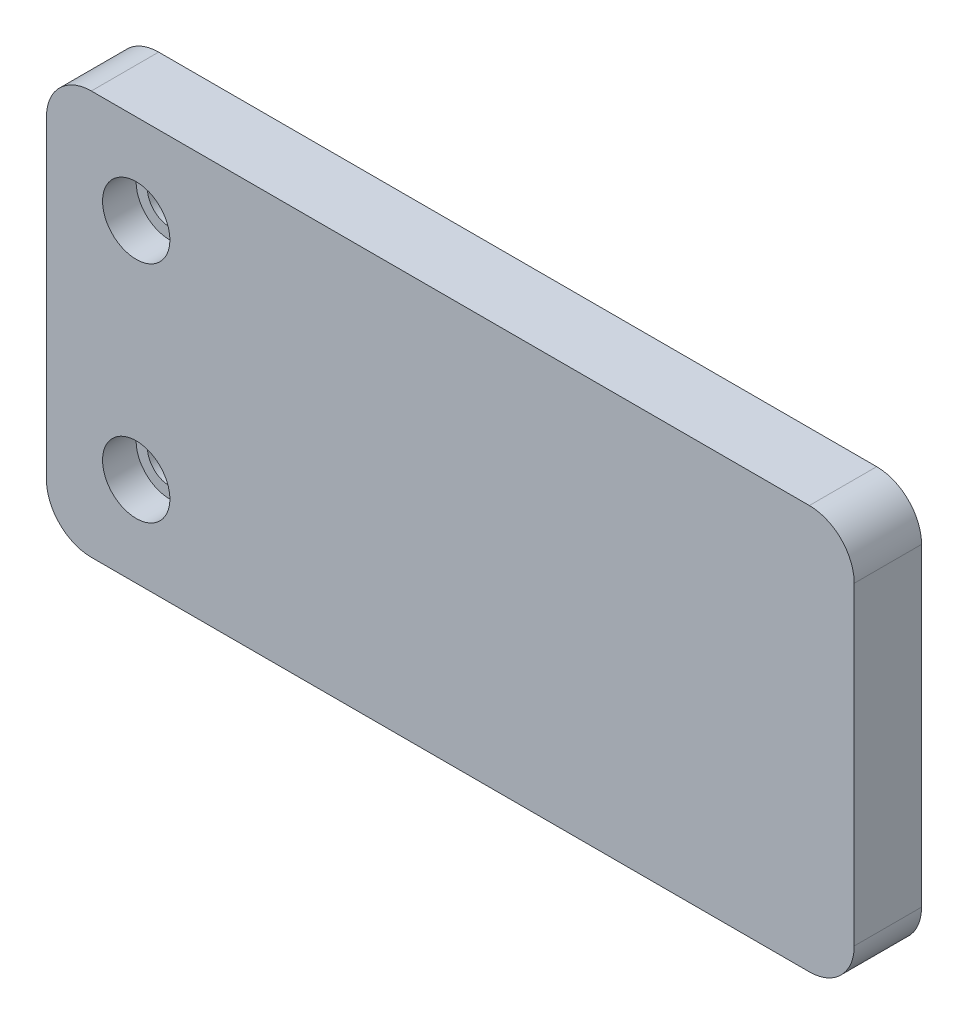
from build123d import *

# Parameters (mm, degrees)
SKETCH2_W           = 114.3
SKETCH2_H           = 57.15
SKETCH2_R           = 3.175
BOSS_EXTRUDE1_DEPTH = 9.525
CUT_EXTRUDE1_START  = 4.7752
SKETCH3_R           = 4.7625
CUT_EXTRUDE1_DEPTH  = 9.525
FILLET1_R           = 6.35


with BuildPart() as part:
    # Sketch2 → Boss-Extrude1 (new body)
    with BuildSketch(Plane.XY):
        with Locations((57.15, 28.575)):
            Rectangle(SKETCH2_W, SKETCH2_H)
        with Locations(Location((12.7, 12.7, 0), (0, 0, 180))):
            Circle(SKETCH2_R, mode=Mode.SUBTRACT)
        with Locations(Location((12.7, 44.45, 0), (0, 0, 180))):
            Circle(SKETCH2_R, mode=Mode.SUBTRACT)
    extrude(amount=BOSS_EXTRUDE1_DEPTH)

    # Sketch3 → Cut-Extrude1 (cut)
    with BuildSketch(Plane.XY.offset(CUT_EXTRUDE1_START)):
        with Locations(Location((12.7, 44.45, 0), (0, 0, 180))):
            Circle(SKETCH3_R)
        with Locations(Location((12.7, 12.7, 0), (0, 0, 180))):
            Circle(SKETCH3_R)
    extrude(amount=CUT_EXTRUDE1_DEPTH, mode=Mode.SUBTRACT)

    # Fillet1
    fillet1_edges = [part.edges().sort_by_distance(p)[0] for p in [
        (0, 57.15, 4.7625),
        (114.3, 57.15, 4.7625),
        (114.3, 0, 4.7625),
        (0, 0, 4.7625),
    ]]
    fillet(fillet1_edges, radius=FILLET1_R)


solid = part.part
